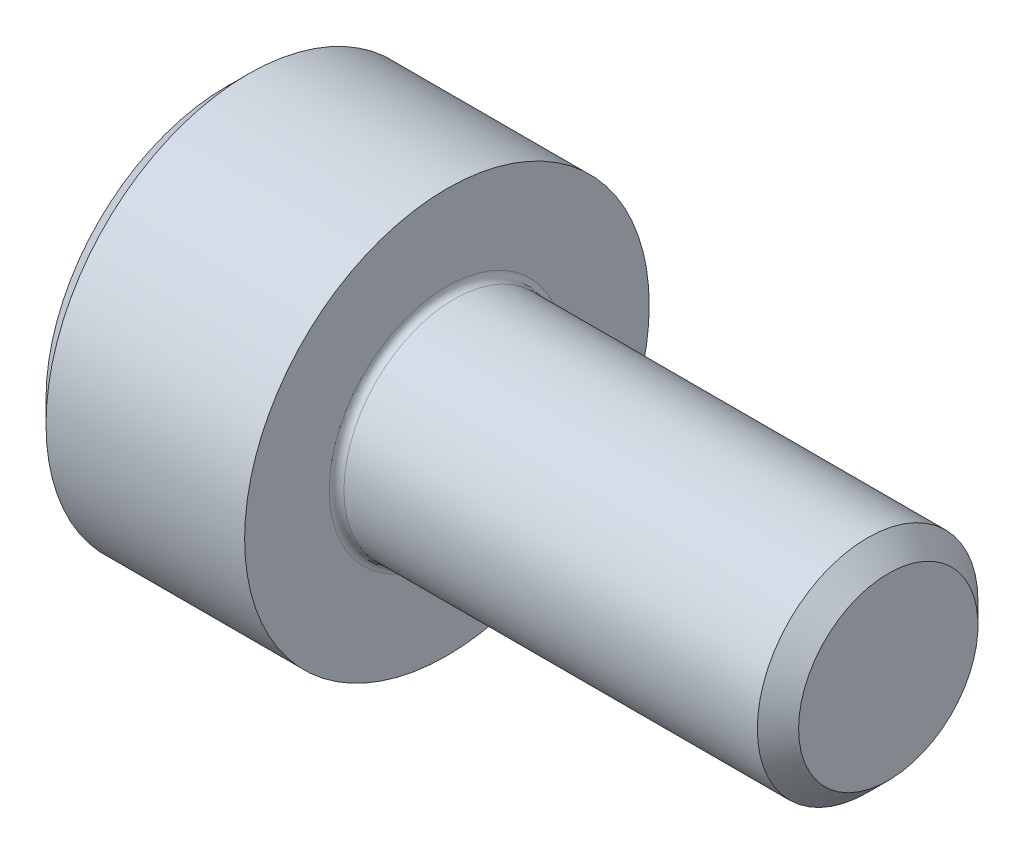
from build123d import *

# Parameters (mm, degrees)
FILLET1_R   = 0.1
HEX_2_DEPTH = 1.3


with BuildPart() as part:
    # BodySke → Base-Revolve (revolve)
    with BuildSketch(Plane.XY, mode=Mode.PRIVATE) as base_revolve_sk:
        Polygon((0, 0), (0, 2.45), (0.3, 2.75), (3, 2.75), (3, 1.5), (8.7195, 1.5), (9, 1.2195), (9, 0), align=None)
    revolve(base_revolve_sk.sketch.rotate(Axis((-31.75, 0, 0), (1, 0, 0)), 90), axis=Axis((-31.75, 0, 0), (1, 0, 0)))

    # Fillet1
    fillet1_edges = [part.edges().sort_by_distance(p)[0] for p in [
        (3, 0, -1.5),
    ]]
    fillet(fillet1_edges, radius=FILLET1_R)

    # Sketch2 → Hex-PreBroach (revolve, cut)
    with BuildSketch(Plane.XY, mode=Mode.PRIVATE) as hex_prebroach_sk:
        Polygon((0, 1.28), (1.3, 1.28), (2.039008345, 0), (0, 0), align=None)
    revolve(hex_prebroach_sk.sketch.rotate(Axis((0, 0, 0), (1, 0, 0)), 90), axis=Axis((0, 0, 0), (1, 0, 0)), mode=Mode.SUBTRACT)

    # Sketch3 → Hex 2 (cut)
    with BuildSketch(Plane(origin=(0, 0, 0), x_dir=(0, 0.500000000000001, 0.866025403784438), z_dir=(-1, 0, 0))):
        Polygon((0.739008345, 1.28), (-0.739008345, 1.28), (-1.478016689, 0), (-0.739008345, -1.28), (0.739008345, -1.28), (1.478016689, 0), align=None)
    extrude(amount=-HEX_2_DEPTH, mode=Mode.SUBTRACT)


solid = part.part
